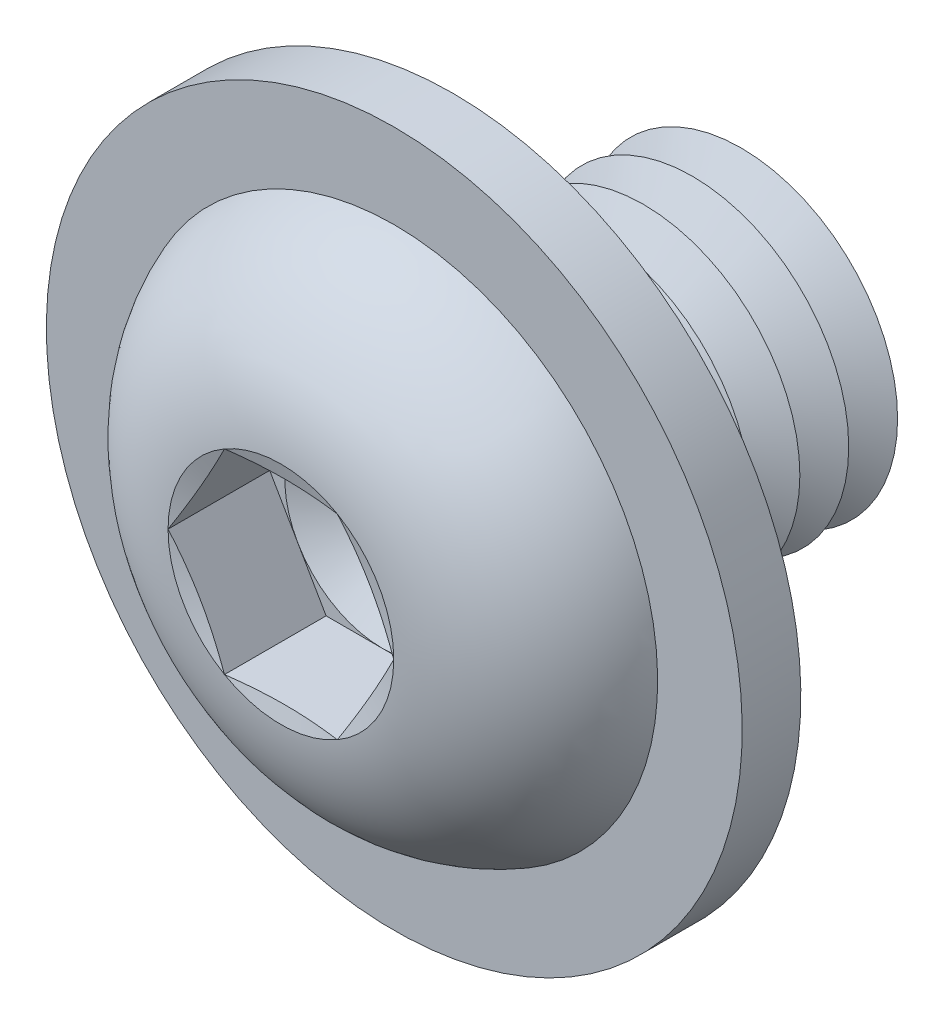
from build123d import *

# Parameters (mm, degrees)
FILLET1_R           = 0.625
LPATTERN1_COUNT     = 6
LPATTERN1_PITCH     = 1.25
CUT_EXTRUDE1_DEPTH  = 2.6
SKETCH5_R           = 8.9
SKETCH5_R_2         = 4.625
BOSS_EXTRUDE1_DEPTH = 1.5


with BuildPart() as part:
    # Sketch1 → Revolve1 (revolve)
    with BuildSketch(Plane(origin=(0, 0, 0), x_dir=(0, 0, -1), z_dir=(1, 0, 0))):
        with BuildLine():
            Line((0, 4), (0, 7))
            ThreePointArc((0, 7), (-3.011595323, 5.81154966), (-4.4, 2.88675))
            Line((-4.4, 2.88675), (-4.013248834, 1.443375))
            Line((-4.013248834, 1.443375), (-4.4, 1.443375))
            Line((-4.4, 1.443375), (-4.4, 0))
            Line((-4.4, 0), (8, 0))
            Line((8, 0), (8, 4))
            Line((8, 4), (0, 4))
        make_face()
    revolve(axis=Axis((0, 0, -8), (0, 0, 1)))

    # Fillet1
    fillet1_edges = [part.edges().sort_by_distance(p)[0] for p in [
        (0, -4, 0),
    ]]
    fillet(fillet1_edges, radius=FILLET1_R)

    # Sketch2 → Cut-Revolve1 (revolve, cut)
    with BuildSketch(Plane(origin=(0, 0, 0), x_dir=(0, 0, -1), z_dir=(1, 0, 0))):
        Polygon((7.375, 4), (8.625, 4), (8, 2.917468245), align=None)
    cut_revolve1 = revolve(axis=Axis((0, 0, -8), (0, 0, -1)), mode=Mode.SUBTRACT)

    # LPattern1: Cut-Revolve1 ×6
    with Locations(*[(0, 0, i * LPATTERN1_PITCH) for i in range(1, LPATTERN1_COUNT)]):
        add(cut_revolve1, mode=Mode.SUBTRACT)

    # Sketch3 → Cut-Extrude1 (cut)
    with BuildSketch(Plane.XY.offset(4.4)):
        Polygon((1.443375, 2.499998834), (-1.443375, 2.499998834), (-2.88675, 0), (-1.443375, -2.499998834), (1.443375, -2.499998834), (2.88675, 0), align=None)
    extrude(amount=-CUT_EXTRUDE1_DEPTH, mode=Mode.SUBTRACT)

    # Cut-Extrude2 cone 1 section (on through the dimple's axis) → Cut-Extrude2 (revolve, cut)
    with BuildSketch(Plane(origin=(0, 0, 1.8), x_dir=(0, -1, 0), z_dir=(1, 0, 0))):
        Polygon((0, 0), (2.499998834, 0), (0, 1.443375), align=None)
    revolve(axis=Axis((0, 0, 1.8), (0, 0, -1)), mode=Mode.SUBTRACT)

    # Sketch5 → Boss-Extrude1 (add)
    with BuildSketch(Plane(origin=(0, 0, 0), x_dir=(-1, 0, 0), z_dir=(0, 0, -1))):
        with Locations(Location((0, 0, 0), (0, 0, 90))):
            Circle(SKETCH5_R)
        Circle(SKETCH5_R_2, mode=Mode.SUBTRACT)
    extrude(amount=-BOSS_EXTRUDE1_DEPTH)


solid = part.part
